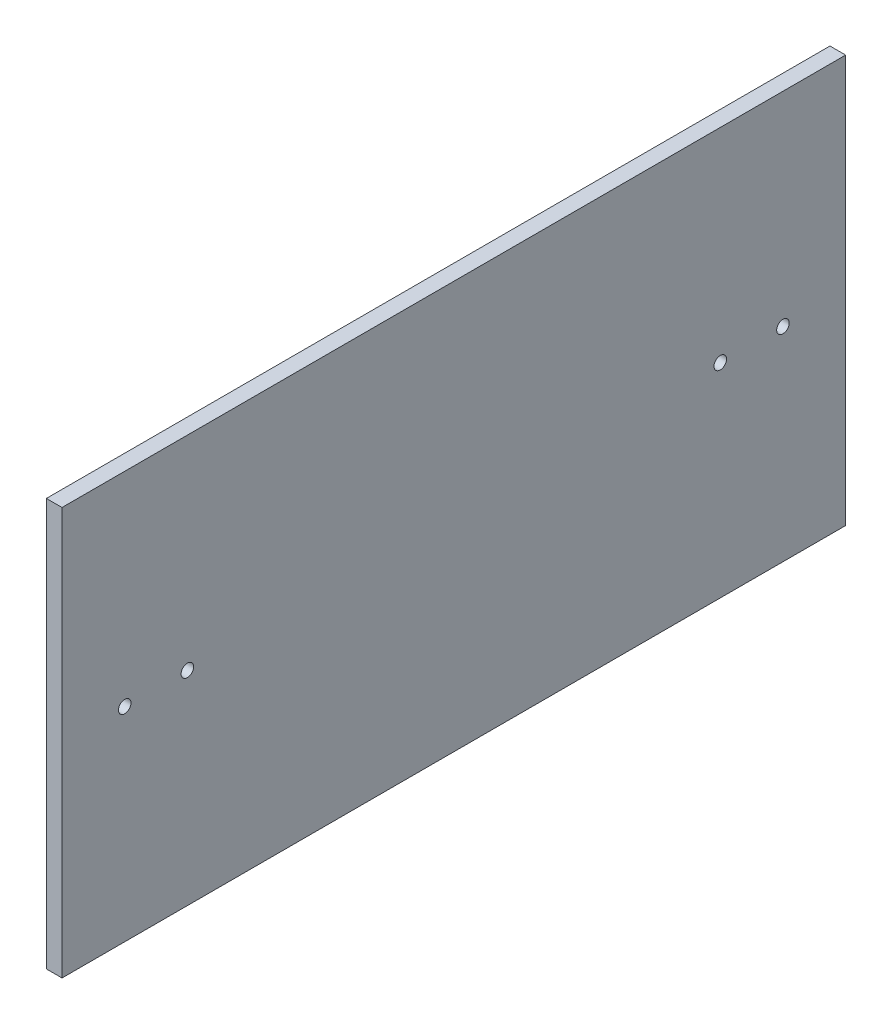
from build123d import *

# Parameters (mm, degrees)
SKETCH1_W           = 317.5
SKETCH1_H           = 165.1
BOSS_EXTRUDE1_DEPTH = 6.35
SKETCH2_R           = 2.54
CUT_EXTRUDE1_DEPTH  = 12.7


with BuildPart() as part:
    # Sketch1 → Boss-Extrude1 (new body)
    with BuildSketch(Plane(origin=(0, 0, 0), x_dir=(0, 0, -1), z_dir=(1, 0, 0))):
        with Locations((158.75, 82.55)):
            Rectangle(SKETCH1_W, SKETCH1_H)
    extrude(amount=BOSS_EXTRUDE1_DEPTH)

    # Sketch2 → Cut-Extrude1 (cut)
    with BuildSketch(Plane(origin=(6.35, 0, 0), x_dir=(0, 0, -1), z_dir=(1, 0, 0))):
        with Locations((292.1, 82.55)):
            Circle(SKETCH2_R)
        with Locations((266.7, 82.55)):
            Circle(SKETCH2_R)
        with Locations((50.8, 82.55)):
            Circle(SKETCH2_R)
        with Locations((25.4, 82.55)):
            Circle(SKETCH2_R)
    extrude(amount=-CUT_EXTRUDE1_DEPTH, mode=Mode.SUBTRACT)


solid = part.part
